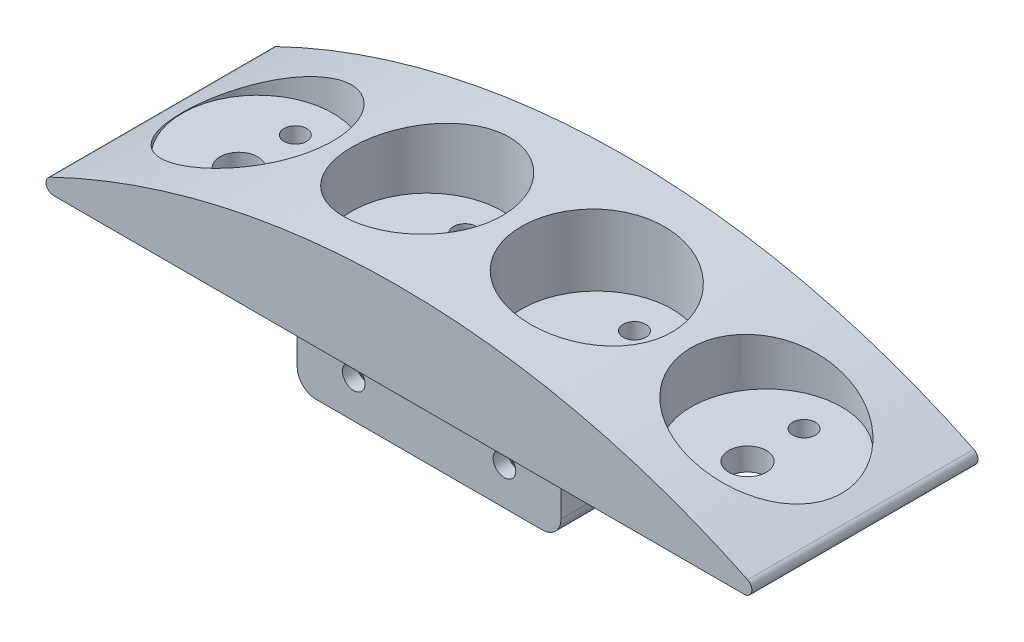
from build123d import *

# Parameters (mm, degrees)
SALIENTE_EXTRUIR1_DEPTH                       = 52
CROQUIS2_W                                    = 70
CROQUIS2_H                                    = 11.5
SALIENTE_EXTRUIR2_DEPTH                       = 20
CROQUIS3_W                                    = 70
CROQUIS3_H                                    = 10
SALIENTE_EXTRUIR3_DEPTH                       = 20
SALIENTE_EXTRUIR4_START                       = 8
SALIENTE_EXTRUIR4_DEPTH                       = 8
PERFORADOR_PARA_ROSCAR_HELICOIL_DE_M392_D     = 40
PERFORADOR_PARA_ROSCAR_HELICOIL_DE_M392_DEPTH = 13.623151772
CROQUIS11_W                                   = 5
CROQUIS11_H                                   = 26
DI_METRO_DE_TALADRO_10_0_10_1_AT_2_COUNT      = 2
DI_METRO_DE_TALADRO_10_0_10_1_AT_2_PITCH      = 135
DI_METRO_DE_TALADRO_10_0_10_1_AT_3_COUNT      = 2
DI_METRO_DE_TALADRO_10_0_10_1_AT_3_PITCH      = 90
DI_METRO_DE_TALADRO_10_0_10_1_AT_4_COUNT      = 2
DI_METRO_DE_TALADRO_10_0_10_1_AT_4_PITCH      = 45
DI_METRO_DE_TALADRO_6_0_6_2_D                 = 6
TALADRO1_AT_2_COUNT                           = 2
TALADRO1_AT_2_PITCH                           = 40
TALADRO2_AT_2_COUNT                           = 2
TALADRO2_AT_2_PITCH                           = 40
PERFORADOR_PARA_ROSCAR_HELICOIL_DE_M_2_D      = 40
PERFORADOR_PARA_ROSCAR_HELICOIL_DE_M_2_DEPTH  = 18.99
REDONDEO1_R                                   = 5
REDONDEO2_R                                   = 2


with BuildPart() as part:
    # Croquis1 → Saliente-Extruir1 (new body)
    with BuildSketch(Plane.XY.offset(52)):
        with BuildLine():
            Line((0, 0), (200, 0))
            ThreePointArc((200, 0), (100, 25), (0, 0))
        make_face()
    extrude(amount=-SALIENTE_EXTRUIR1_DEPTH)

    # Croquis2 → Saliente-Extruir2 (add)
    with BuildSketch(Plane.XZ):
        with Locations((100, 5.75)):
            Rectangle(CROQUIS2_W, CROQUIS2_H)
    extrude(amount=SALIENTE_EXTRUIR2_DEPTH)

    # Croquis3 → Saliente-Extruir3 (add)
    with BuildSketch(Plane.XZ):
        with Locations((100, 47)):
            Rectangle(CROQUIS3_W, CROQUIS3_H)
    extrude(amount=SALIENTE_EXTRUIR3_DEPTH)

    # Croquis6 → Saliente-Extruir4 (add)
    with BuildSketch(Plane.XY.offset(52).offset(SALIENTE_EXTRUIR4_START)):
        with BuildLine():
            Line((200, 0), (0, 0))
            ThreePointArc((0, 0), (100, 25), (200, 0))
        make_face()
    extrude(amount=-SALIENTE_EXTRUIR4_DEPTH)

    # Perforador para roscar Helicoil de M392
    with Locations(Plane(origin=(0, 19.623151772, 0), x_dir=(1, 0, 0), z_dir=(0, 1, 0))):
        with Locations((167.5, -30), (32.5, -30)):
            Hole(PERFORADOR_PARA_ROSCAR_HELICOIL_DE_M392_D / 2, depth=PERFORADOR_PARA_ROSCAR_HELICOIL_DE_M392_DEPTH)

    # Croquis11 → Di_metro de taladro _10.0 _10_1 (revolve, cut)
    with BuildSketch(Plane(origin=(167.5, 6, 35), x_dir=(0, 0, 1), z_dir=(1, 0, 0))):
        with Locations((2.5, 13)):
            Rectangle(CROQUIS11_W, CROQUIS11_H)
    di_metro_de_taladro_10_0_10_1 = revolve(axis=Axis((167.5, 12.35, 35), (0, -1, 0)), mode=Mode.SUBTRACT)

    # Di_metro de taladro _10.0 _10_1 at 2: Di_metro de taladro _10.0 _10_1 ×2
    with Locations(*[(-i * DI_METRO_DE_TALADRO_10_0_10_1_AT_2_PITCH, 0, 0) for i in range(1, DI_METRO_DE_TALADRO_10_0_10_1_AT_2_COUNT)]):
        add(di_metro_de_taladro_10_0_10_1, mode=Mode.SUBTRACT)

    # Di_metro de taladro _10.0 _10_1 at 3: Di_metro de taladro _10.0 _10_1 ×2
    with Locations(*[(-i * DI_METRO_DE_TALADRO_10_0_10_1_AT_3_PITCH, 0, 0) for i in range(1, DI_METRO_DE_TALADRO_10_0_10_1_AT_3_COUNT)]):
        add(di_metro_de_taladro_10_0_10_1, mode=Mode.SUBTRACT)

    # Di_metro de taladro _10.0 _10_1 at 4: Di_metro de taladro _10.0 _10_1 ×2
    with Locations(*[(-i * DI_METRO_DE_TALADRO_10_0_10_1_AT_4_PITCH, 0, 0) for i in range(1, DI_METRO_DE_TALADRO_10_0_10_1_AT_4_COUNT)]):
        add(di_metro_de_taladro_10_0_10_1, mode=Mode.SUBTRACT)

    # Di_metro de taladro _6.0 _6_2 (through all)
    with Locations(Plane(origin=(0, 0, 0), x_dir=(-1, 0, 0), z_dir=(0, -1, 0))):
        with Locations((-167.5, -20), (-32.5, -20), (-122.5, -20), (-77.5, -20)):
            Hole(DI_METRO_DE_TALADRO_6_0_6_2_D / 2)

    # Croquis15 → Taladro1 (revolve, cut)
    with BuildSketch(Plane(origin=(80, -10, 11.5), x_dir=(0, -1, 0), z_dir=(1, 0, 0))):
        Polygon((0, 0), (0, 11.5), (3, 11.5), (3, 2.8), (4, 1.8), (4, 0), align=None)
    taladro1 = revolve(axis=Axis((80, -10, 17.630023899), (0, 0, -1)), mode=Mode.SUBTRACT)

    # Taladro1 at 2: Taladro1 ×2
    with Locations(*[(i * TALADRO1_AT_2_PITCH, 0, 0) for i in range(1, TALADRO1_AT_2_COUNT)]):
        add(taladro1, mode=Mode.SUBTRACT)

    # Croquis17 → Taladro2 (revolve, cut)
    with BuildSketch(Plane(origin=(120, -10, 42), x_dir=(0, 1, 0), z_dir=(1, 0, 0))):
        Polygon((0, 0), (0, 18), (3, 18), (3, 6.3), (4, 5.3), (4, 0), align=None)
    taladro2 = revolve(axis=Axis((120, -10, 35.869976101), (0, 0, 1)), mode=Mode.SUBTRACT)

    # Taladro2 at 2: Taladro2 ×2
    with Locations(*[(-i * TALADRO2_AT_2_PITCH, 0, 0) for i in range(1, TALADRO2_AT_2_COUNT)]):
        add(taladro2, mode=Mode.SUBTRACT)

    # Perforador para roscar Helicoil de M 2
    with Locations(Plane(origin=(0, 24.985293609, 0), x_dir=(1, 0, 0), z_dir=(0, 1, 0))):
        with Locations((77.5, -30), (122.5, -30)):
            Hole(PERFORADOR_PARA_ROSCAR_HELICOIL_DE_M_2_D / 2, depth=PERFORADOR_PARA_ROSCAR_HELICOIL_DE_M_2_DEPTH)

    # Redondeo1
    redondeo1_edges = [part.edges().sort_by_distance(p)[0] for p in [
        (135, 0, 5.75),
        (65, 0, 5.75),
        (135, -20, 5.75),
        (65, -20, 5.75),
        (65, 0, 47),
        (135, 0, 47),
        (65, -20, 47),
        (135, -20, 47),
    ]]
    fillet(redondeo1_edges, radius=REDONDEO1_R)

    # Redondeo2
    redondeo2_edges = [part.edges().sort_by_distance(p)[0] for p in [
        (200, 0, 30),
        (0, 0, 30),
    ]]
    fillet(redondeo2_edges, radius=REDONDEO2_R)


solid = part.part
